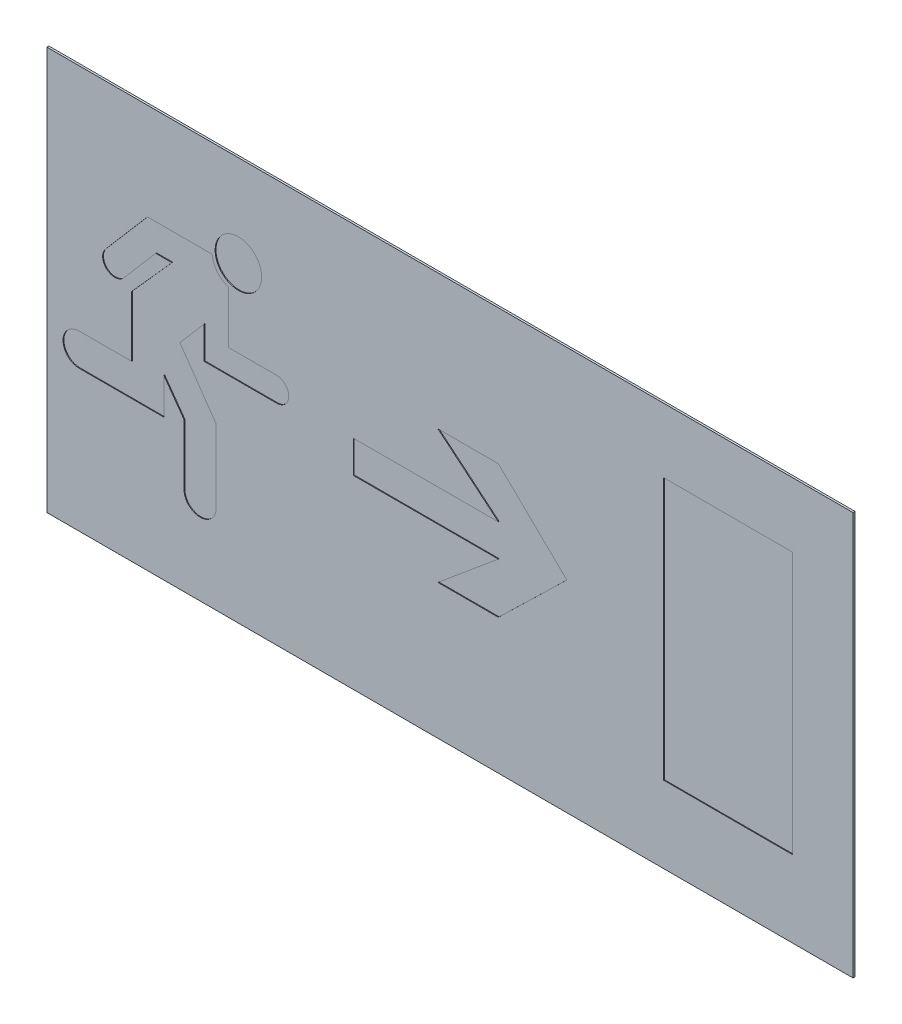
from build123d import *

# Parameters (mm, degrees)
ESQUISSE1_W             = 200
ESQUISSE1_H             = 100
EXTRUSION1_DEPTH        = 0.5
ESQUISSE2_W             = 32
ESQUISSE2_H             = 65
ENL_V_MAT_EXTRU_1_DEPTH = 0.2
ENL_V_MAT_EXTRU_2_DEPTH = 0.2
ESQUISSE6_R             = 5.767770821
ENL_V_MAT_EXTRU_3_DEPTH = 0.2


with BuildPart() as part:
    # Esquisse1 → Extrusion1 (new body)
    with BuildSketch(Plane.XY):
        Rectangle(ESQUISSE1_W, ESQUISSE1_H)
    extrude(amount=EXTRUSION1_DEPTH)

    # Esquisse2 → Enl_v. mat.-Extru.1 (cut)
    with BuildSketch(Plane.XY.offset(0.5)):
        with Locations((69, 1.5)):
            Rectangle(ESQUISSE2_W, ESQUISSE2_H)
    extrude(amount=-ENL_V_MAT_EXTRU_1_DEPTH, mode=Mode.SUBTRACT)

    # Esquisse4 → Enl_v. mat.-Extru.2 (cut)
    with BuildSketch(Plane.XY.offset(0.5)):
        Polygon((-24, 4), (-24, -4), (12, -4), (-3, -16.5), (12, -16.5), (29.000000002, 0), (12, 16.5), (-3, 16.5), (12, 4), align=None)
    extrude(amount=-ENL_V_MAT_EXTRU_2_DEPTH, mode=Mode.SUBTRACT)

    # Esquisse6 → Enl_v. mat.-Extru.3 (cut)
    with BuildSketch(Plane.XY.offset(0.5)):
        with Locations((-52.5, 27.25)):
            Circle(ESQUISSE6_R)
        with BuildLine():
            Line((-79, -7), (-79, 7.999999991))
            Line((-79, 7.999999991), (-69, 19.1969542))
            Line((-69, 19.1969542), (-73, 19.1969542))
            Line((-73, 19.1969542), (-80.9008478, 10))
            ThreePointArc((-80.9008478, 10), (-85.131350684, 9.67930487), (-85.45204581, 13.909807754))
            Line((-85.45204581, 13.909807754), (-75.06569758, 25.999999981))
            Line((-75.06569758, 25.999999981), (-59, 25.999999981))
            ThreePointArc((-59, 25.999999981), (-57.769018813, 22.884784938), (-55, 21))
            Line((-55, 21), (-55, 8))
            Line((-55, 8), (-43, 8))
            ThreePointArc((-43, 8), (-40, 5), (-43, 2))
            Line((-43, 2), (-61, 2))
            Line((-61, 2), (-61, 10))
            Line((-61, 10), (-67, 3))
            Line((-67, 3), (-57.99999999, -10.000000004))
            Line((-57.99999999, -10.000000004), (-57.99999999, -28))
            ThreePointArc((-57.99999999, -28), (-61.99999999, -32), (-65.99999999, -28))
            Line((-65.99999999, -28), (-65.99999999, -13))
            Line((-65.99999999, -13), (-70.999999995, -6))
            Line((-70.999999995, -6), (-70.999999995, -15))
            Line((-70.999999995, -15), (-92, -15))
            ThreePointArc((-92, -15), (-96, -11), (-92, -7))
            Line((-92, -7), (-79, -7))
        make_face()
    extrude(amount=-ENL_V_MAT_EXTRU_3_DEPTH, mode=Mode.SUBTRACT)


solid = part.part
